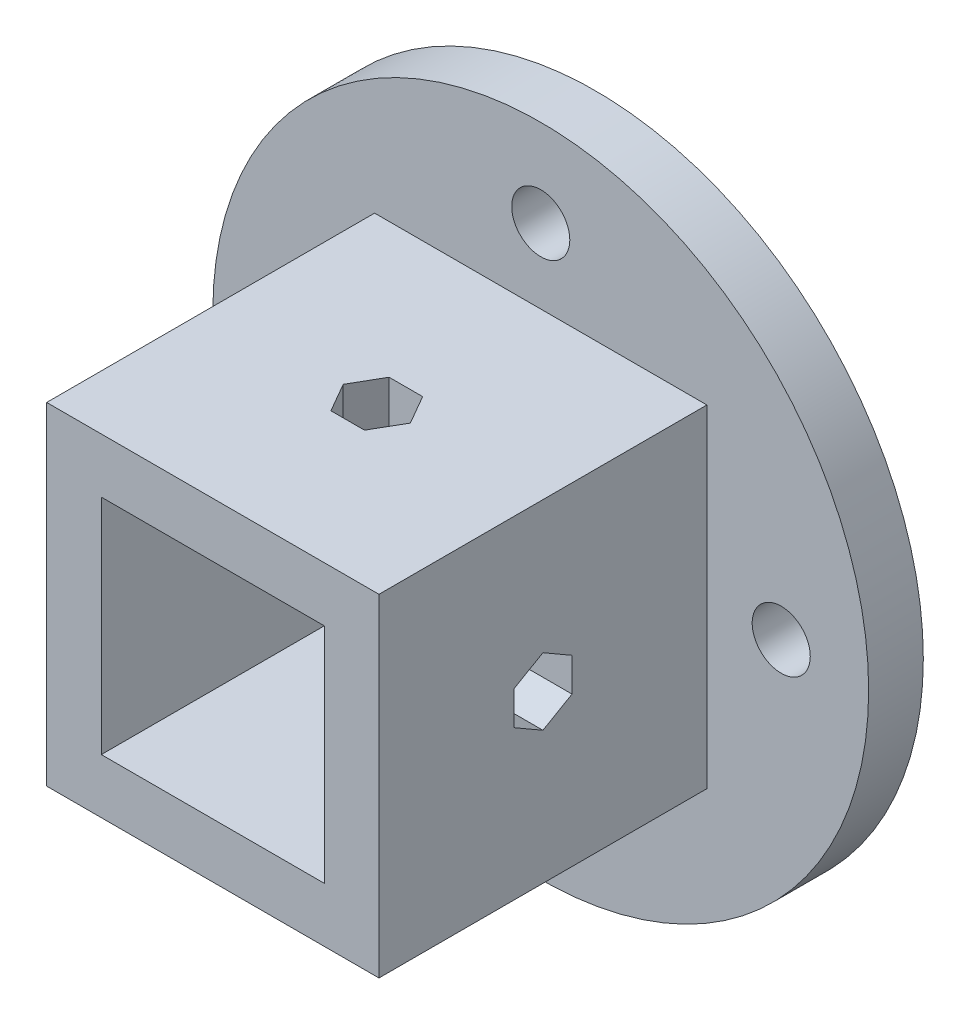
ISO-10303-21;
HEADER;
FILE_DESCRIPTION(('STEP AP214'),'2;1');
FILE_NAME('part.step','',(''),(''),'','','');
FILE_SCHEMA(('AUTOMOTIVE_DESIGN { 1 0 10303 214 1 1 1 1 }'));
ENDSEC;
DATA;
#1=APPLICATION_CONTEXT('core data for automotive mechanical design processes');
#2=APPLICATION_PROTOCOL_DEFINITION('international standard','automotive_design',2000,#1);
#3=PRODUCT_CONTEXT('',#1,'mechanical');
#4=PRODUCT('Part','Part','',(#3));
#5=PRODUCT_RELATED_PRODUCT_CATEGORY('part','',(#4));
#6=PRODUCT_DEFINITION_FORMATION('','',#4);
#7=PRODUCT_DEFINITION_CONTEXT('part definition',#1,'design');
#8=PRODUCT_DEFINITION('design','',#6,#7);
#9=PRODUCT_DEFINITION_SHAPE('','',#8);
#10=(LENGTH_UNIT() NAMED_UNIT(*) SI_UNIT(.MILLI.,.METRE.));
#11=(NAMED_UNIT(*) PLANE_ANGLE_UNIT() SI_UNIT($,.RADIAN.));
#12=(NAMED_UNIT(*) SI_UNIT($,.STERADIAN.) SOLID_ANGLE_UNIT());
#13=UNCERTAINTY_MEASURE_WITH_UNIT(LENGTH_MEASURE(1.E-05),#10,'distance_accuracy_value','');
#14=(GEOMETRIC_REPRESENTATION_CONTEXT(3) GLOBAL_UNCERTAINTY_ASSIGNED_CONTEXT((#13)) GLOBAL_UNIT_ASSIGNED_CONTEXT((#10,
#11,#12)) REPRESENTATION_CONTEXT('',''));
#15=CARTESIAN_POINT('',(0.,0.,0.));
#16=DIRECTION('',(0.,0.,1.));
#17=DIRECTION('',(1.,0.,0.));
#18=AXIS2_PLACEMENT_3D('',#15,#16,#17);
#19=CARTESIAN_POINT('',(-27.94,0.,6.35));
#20=DIRECTION('',(0.,0.,-1.));
#21=DIRECTION('',(-1.,0.,0.));
#22=AXIS2_PLACEMENT_3D('',#19,#20,#21);
#23=CYLINDRICAL_SURFACE('',#22,3.375);
#24=CARTESIAN_POINT('',(-27.94,0.,6.35));
#25=DIRECTION('',(0.,0.,1.));
#26=DIRECTION('',(1.,0.,0.));
#27=AXIS2_PLACEMENT_3D('',#24,#25,#26);
#28=CIRCLE('',#27,3.375);
#29=CARTESIAN_POINT('',(-24.565,0.,6.35));
#30=VERTEX_POINT('',#29);
#31=EDGE_CURVE('E538',#30,#30,#28,.T.);
#32=ORIENTED_EDGE('',*,*,#31,.T.);
#33=EDGE_LOOP('',(#32));
#34=FACE_BOUND('',#33,.T.);
#35=CARTESIAN_POINT('',(-27.94,0.,0.));
#36=DIRECTION('',(0.,0.,1.));
#37=DIRECTION('',(1.,0.,0.));
#38=AXIS2_PLACEMENT_3D('',#35,#36,#37);
#39=CIRCLE('',#38,3.375);
#40=CARTESIAN_POINT('',(-24.565,0.,0.));
#41=VERTEX_POINT('',#40);
#42=EDGE_CURVE('E572',#41,#41,#39,.T.);
#43=ORIENTED_EDGE('',*,*,#42,.F.);
#44=EDGE_LOOP('',(#43));
#45=FACE_BOUND('',#44,.T.);
#46=ADVANCED_FACE('F47',(#34,#45),#23,.F.);
#47=CARTESIAN_POINT('',(0.,27.94,6.35));
#48=DIRECTION('',(0.,0.,-1.));
#49=DIRECTION('',(-1.,0.,0.));
#50=AXIS2_PLACEMENT_3D('',#47,#48,#49);
#51=CYLINDRICAL_SURFACE('',#50,3.375);
#52=CARTESIAN_POINT('',(0.,27.94,6.35));
#53=DIRECTION('',(0.,0.,1.));
#54=DIRECTION('',(1.,0.,0.));
#55=AXIS2_PLACEMENT_3D('',#52,#53,#54);
#56=CIRCLE('',#55,3.375);
#57=CARTESIAN_POINT('',(3.37500000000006,27.94,6.35));
#58=VERTEX_POINT('',#57);
#59=EDGE_CURVE('E534',#58,#58,#56,.T.);
#60=ORIENTED_EDGE('',*,*,#59,.T.);
#61=EDGE_LOOP('',(#60));
#62=FACE_BOUND('',#61,.T.);
#63=CARTESIAN_POINT('',(0.,27.94,0.));
#64=DIRECTION('',(0.,0.,1.));
#65=DIRECTION('',(1.,0.,0.));
#66=AXIS2_PLACEMENT_3D('',#63,#64,#65);
#67=CIRCLE('',#66,3.375);
#68=CARTESIAN_POINT('',(3.37500000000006,27.94,0.));
#69=VERTEX_POINT('',#68);
#70=EDGE_CURVE('E568',#69,#69,#67,.T.);
#71=ORIENTED_EDGE('',*,*,#70,.F.);
#72=EDGE_LOOP('',(#71));
#73=FACE_BOUND('',#72,.T.);
#74=ADVANCED_FACE('F708',(#62,#73),#51,.F.);
#75=CARTESIAN_POINT('',(27.9400000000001,0.,6.35));
#76=DIRECTION('',(0.,0.,-1.));
#77=DIRECTION('',(-1.,0.,0.));
#78=AXIS2_PLACEMENT_3D('',#75,#76,#77);
#79=CYLINDRICAL_SURFACE('',#78,3.375);
#80=CARTESIAN_POINT('',(27.9400000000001,0.,6.35));
#81=DIRECTION('',(0.,0.,1.));
#82=DIRECTION('',(1.,0.,0.));
#83=AXIS2_PLACEMENT_3D('',#80,#81,#82);
#84=CIRCLE('',#83,3.375);
#85=CARTESIAN_POINT('',(31.3150000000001,0.,6.35));
#86=VERTEX_POINT('',#85);
#87=EDGE_CURVE('E529',#86,#86,#84,.T.);
#88=ORIENTED_EDGE('',*,*,#87,.T.);
#89=EDGE_LOOP('',(#88));
#90=FACE_BOUND('',#89,.T.);
#91=CARTESIAN_POINT('',(27.9400000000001,0.,0.));
#92=DIRECTION('',(0.,0.,1.));
#93=DIRECTION('',(1.,0.,0.));
#94=AXIS2_PLACEMENT_3D('',#91,#92,#93);
#95=CIRCLE('',#94,3.375);
#96=CARTESIAN_POINT('',(31.3150000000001,0.,0.));
#97=VERTEX_POINT('',#96);
#98=EDGE_CURVE('E564',#97,#97,#95,.T.);
#99=ORIENTED_EDGE('',*,*,#98,.F.);
#100=EDGE_LOOP('',(#99));
#101=FACE_BOUND('',#100,.T.);
#102=ADVANCED_FACE('F714',(#90,#101),#79,.F.);
#103=CARTESIAN_POINT('',(0.,-27.9400000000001,6.35));
#104=DIRECTION('',(0.,0.,-1.));
#105=DIRECTION('',(-1.,0.,0.));
#106=AXIS2_PLACEMENT_3D('',#103,#104,#105);
#107=CYLINDRICAL_SURFACE('',#106,3.375);
#108=CARTESIAN_POINT('',(0.,-27.9400000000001,6.35));
#109=DIRECTION('',(0.,0.,1.));
#110=DIRECTION('',(1.,0.,0.));
#111=AXIS2_PLACEMENT_3D('',#108,#109,#110);
#112=CIRCLE('',#111,3.375);
#113=CARTESIAN_POINT('',(3.37499999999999,-27.9400000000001,6.35));
#114=VERTEX_POINT('',#113);
#115=EDGE_CURVE('E525',#114,#114,#112,.T.);
#116=ORIENTED_EDGE('',*,*,#115,.T.);
#117=EDGE_LOOP('',(#116));
#118=FACE_BOUND('',#117,.T.);
#119=CARTESIAN_POINT('',(0.,-27.9400000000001,0.));
#120=DIRECTION('',(0.,0.,1.));
#121=DIRECTION('',(1.,0.,0.));
#122=AXIS2_PLACEMENT_3D('',#119,#120,#121);
#123=CIRCLE('',#122,3.375);
#124=CARTESIAN_POINT('',(3.37499999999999,-27.9400000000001,0.));
#125=VERTEX_POINT('',#124);
#126=EDGE_CURVE('E510',#125,#125,#123,.T.);
#127=ORIENTED_EDGE('',*,*,#126,.F.);
#128=EDGE_LOOP('',(#127));
#129=FACE_BOUND('',#128,.T.);
#130=ADVANCED_FACE('F49',(#118,#129),#107,.F.);
#131=CARTESIAN_POINT('',(0.,0.,6.35));
#132=DIRECTION('',(0.,0.,-1.));
#133=DIRECTION('',(-1.,0.,0.));
#134=AXIS2_PLACEMENT_3D('',#131,#132,#133);
#135=CYLINDRICAL_SURFACE('',#134,38.1);
#136=CARTESIAN_POINT('',(0.,0.,6.35));
#137=DIRECTION('',(0.,0.,1.));
#138=DIRECTION('',(1.,0.,0.));
#139=AXIS2_PLACEMENT_3D('',#136,#137,#138);
#140=CIRCLE('',#139,38.1);
#141=CARTESIAN_POINT('',(38.1,0.,6.35));
#142=VERTEX_POINT('',#141);
#143=EDGE_CURVE('E556',#142,#142,#140,.T.);
#144=ORIENTED_EDGE('',*,*,#143,.F.);
#145=EDGE_LOOP('',(#144));
#146=FACE_BOUND('',#145,.T.);
#147=CARTESIAN_POINT('',(0.,0.,0.));
#148=DIRECTION('',(0.,0.,1.));
#149=DIRECTION('',(1.,0.,0.));
#150=AXIS2_PLACEMENT_3D('',#147,#148,#149);
#151=CIRCLE('',#150,38.1);
#152=CARTESIAN_POINT('',(38.1,0.,0.));
#153=VERTEX_POINT('',#152);
#154=EDGE_CURVE('E530',#153,#153,#151,.T.);
#155=ORIENTED_EDGE('',*,*,#154,.T.);
#156=EDGE_LOOP('',(#155));
#157=FACE_BOUND('',#156,.T.);
#158=ADVANCED_FACE('F719',(#146,#157),#135,.T.);
#159=CARTESIAN_POINT('',(0.,0.,6.35));
#160=DIRECTION('',(0.,0.,1.));
#161=DIRECTION('',(1.,0.,0.));
#162=AXIS2_PLACEMENT_3D('',#159,#160,#161);
#163=PLANE('',#162);
#164=ORIENTED_EDGE('',*,*,#115,.F.);
#165=EDGE_LOOP('',(#164));
#166=FACE_BOUND('',#165,.T.);
#167=ORIENTED_EDGE('',*,*,#87,.F.);
#168=EDGE_LOOP('',(#167));
#169=FACE_BOUND('',#168,.T.);
#170=ORIENTED_EDGE('',*,*,#59,.F.);
#171=EDGE_LOOP('',(#170));
#172=FACE_BOUND('',#171,.T.);
#173=ORIENTED_EDGE('',*,*,#31,.F.);
#174=EDGE_LOOP('',(#173));
#175=FACE_BOUND('',#174,.T.);
#176=DIRECTION('',(0.,-1.,0.));
#177=VECTOR('',#176,1.);
#178=CARTESIAN_POINT('',(19.304,0.,6.35));
#179=LINE('',#178,#177);
#180=CARTESIAN_POINT('',(19.304,19.304,6.35));
#181=VERTEX_POINT('',#180);
#182=CARTESIAN_POINT('',(19.304,-19.304,6.35));
#183=VERTEX_POINT('',#182);
#184=EDGE_CURVE('E542',#181,#183,#179,.T.);
#185=ORIENTED_EDGE('',*,*,#184,.T.);
#186=DIRECTION('',(-1.,0.,0.));
#187=VECTOR('',#186,1.);
#188=CARTESIAN_POINT('',(0.,-19.304,6.35));
#189=LINE('',#188,#187);
#190=CARTESIAN_POINT('',(-19.304,-19.304,6.35));
#191=VERTEX_POINT('',#190);
#192=EDGE_CURVE('E545',#183,#191,#189,.T.);
#193=ORIENTED_EDGE('',*,*,#192,.T.);
#194=DIRECTION('',(0.,-1.,0.));
#195=VECTOR('',#194,1.);
#196=CARTESIAN_POINT('',(-19.304,0.,6.35));
#197=LINE('',#196,#195);
#198=CARTESIAN_POINT('',(-19.304,19.304,6.35));
#199=VERTEX_POINT('',#198);
#200=EDGE_CURVE('E548',#199,#191,#197,.T.);
#201=ORIENTED_EDGE('',*,*,#200,.F.);
#202=DIRECTION('',(-1.,0.,0.));
#203=VECTOR('',#202,1.);
#204=CARTESIAN_POINT('',(0.,19.304,6.35));
#205=LINE('',#204,#203);
#206=EDGE_CURVE('E552',#181,#199,#205,.T.);
#207=ORIENTED_EDGE('',*,*,#206,.F.);
#208=EDGE_LOOP('',(#185,#193,#201,#207));
#209=FACE_BOUND('',#208,.T.);
#210=ORIENTED_EDGE('',*,*,#143,.T.);
#211=EDGE_LOOP('',(#210));
#212=FACE_BOUND('',#211,.T.);
#213=ADVANCED_FACE('F735',(#166,#169,#172,#175,#209,#212),#163,.T.);
#214=CARTESIAN_POINT('',(0.,0.,0.));
#215=DIRECTION('',(0.,0.,1.));
#216=DIRECTION('',(1.,0.,0.));
#217=AXIS2_PLACEMENT_3D('',#214,#215,#216);
#218=PLANE('',#217);
#219=ORIENTED_EDGE('',*,*,#126,.T.);
#220=EDGE_LOOP('',(#219));
#221=FACE_BOUND('',#220,.T.);
#222=ORIENTED_EDGE('',*,*,#98,.T.);
#223=EDGE_LOOP('',(#222));
#224=FACE_BOUND('',#223,.T.);
#225=ORIENTED_EDGE('',*,*,#70,.T.);
#226=EDGE_LOOP('',(#225));
#227=FACE_BOUND('',#226,.T.);
#228=ORIENTED_EDGE('',*,*,#42,.T.);
#229=EDGE_LOOP('',(#228));
#230=FACE_BOUND('',#229,.T.);
#231=ORIENTED_EDGE('',*,*,#154,.F.);
#232=EDGE_LOOP('',(#231));
#233=FACE_BOUND('',#232,.T.);
#234=DIRECTION('',(0.,-1.,0.));
#235=VECTOR('',#234,1.);
#236=CARTESIAN_POINT('',(12.954,0.,0.));
#237=LINE('',#236,#235);
#238=CARTESIAN_POINT('',(12.954,12.954,0.));
#239=VERTEX_POINT('',#238);
#240=CARTESIAN_POINT('',(12.954,-12.954,0.));
#241=VERTEX_POINT('',#240);
#242=EDGE_CURVE('E450',#239,#241,#237,.T.);
#243=ORIENTED_EDGE('',*,*,#242,.F.);
#244=DIRECTION('',(-1.,0.,0.));
#245=VECTOR('',#244,1.);
#246=CARTESIAN_POINT('',(0.,12.954,0.));
#247=LINE('',#246,#245);
#248=CARTESIAN_POINT('',(-12.954,12.954,0.));
#249=VERTEX_POINT('',#248);
#250=EDGE_CURVE('E456',#239,#249,#247,.T.);
#251=ORIENTED_EDGE('',*,*,#250,.T.);
#252=DIRECTION('',(0.,-1.,0.));
#253=VECTOR('',#252,1.);
#254=CARTESIAN_POINT('',(-12.954,0.,0.));
#255=LINE('',#254,#253);
#256=CARTESIAN_POINT('',(-12.954,-12.954,0.));
#257=VERTEX_POINT('',#256);
#258=EDGE_CURVE('E489',#249,#257,#255,.T.);
#259=ORIENTED_EDGE('',*,*,#258,.T.);
#260=DIRECTION('',(-1.,0.,0.));
#261=VECTOR('',#260,1.);
#262=CARTESIAN_POINT('',(0.,-12.954,0.));
#263=LINE('',#262,#261);
#264=EDGE_CURVE('E485',#241,#257,#263,.T.);
#265=ORIENTED_EDGE('',*,*,#264,.F.);
#266=EDGE_LOOP('',(#243,#251,#259,#265));
#267=FACE_BOUND('',#266,.T.);
#268=ADVANCED_FACE('F731',(#221,#224,#227,#230,#233,#267),#218,.F.);
#269=CARTESIAN_POINT('',(12.954,0.,44.45));
#270=DIRECTION('',(1.,0.,0.));
#271=DIRECTION('',(0.,0.,-1.));
#272=AXIS2_PLACEMENT_3D('',#269,#270,#271);
#273=PLANE('',#272);
#274=DIRECTION('',(0.,-0.5,0.866025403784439));
#275=VECTOR('',#274,1.);
#276=CARTESIAN_POINT('',(12.954,-5.32328495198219,41.3766));
#277=LINE('',#276,#275);
#278=CARTESIAN_POINT('',(12.954,3.90080935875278,25.4));
#279=VERTEX_POINT('',#278);
#280=CARTESIAN_POINT('',(12.954,1.95040467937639,28.7782));
#281=VERTEX_POINT('',#280);
#282=EDGE_CURVE('E343',#279,#281,#277,.T.);
#283=ORIENTED_EDGE('',*,*,#282,.T.);
#284=DIRECTION('',(0.,-1.,0.));
#285=VECTOR('',#284,1.);
#286=CARTESIAN_POINT('',(12.954,0.,28.7782));
#287=LINE('',#286,#285);
#288=CARTESIAN_POINT('',(12.954,-1.9504046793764,28.7782));
#289=VERTEX_POINT('',#288);
#290=EDGE_CURVE('E350',#281,#289,#287,.T.);
#291=ORIENTED_EDGE('',*,*,#290,.T.);
#292=DIRECTION('',(0.,-0.5,-0.866025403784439));
#293=VECTOR('',#292,1.);
#294=CARTESIAN_POINT('',(12.954,5.32328495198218,41.3766));
#295=LINE('',#294,#293);
#296=CARTESIAN_POINT('',(12.954,-3.90080935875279,25.4));
#297=VERTEX_POINT('',#296);
#298=EDGE_CURVE('E318',#289,#297,#295,.T.);
#299=ORIENTED_EDGE('',*,*,#298,.T.);
#300=DIRECTION('',(0.,0.5,-0.866025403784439));
#301=VECTOR('',#300,1.);
#302=CARTESIAN_POINT('',(12.954,-11.1744989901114,37.9984));
#303=LINE('',#302,#301);
#304=CARTESIAN_POINT('',(12.954,-1.9504046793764,22.0218));
#305=VERTEX_POINT('',#304);
#306=EDGE_CURVE('E262',#297,#305,#303,.T.);
#307=ORIENTED_EDGE('',*,*,#306,.T.);
#308=DIRECTION('',(0.,1.,0.));
#309=VECTOR('',#308,1.);
#310=CARTESIAN_POINT('',(12.954,0.,22.0218));
#311=LINE('',#310,#309);
#312=CARTESIAN_POINT('',(12.954,1.95040467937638,22.0218));
#313=VERTEX_POINT('',#312);
#314=EDGE_CURVE('E329',#305,#313,#311,.T.);
#315=ORIENTED_EDGE('',*,*,#314,.T.);
#316=DIRECTION('',(0.,0.5,0.866025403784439));
#317=VECTOR('',#316,1.);
#318=CARTESIAN_POINT('',(12.954,11.1744989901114,37.9984));
#319=LINE('',#318,#317);
#320=EDGE_CURVE('E336',#313,#279,#319,.T.);
#321=ORIENTED_EDGE('',*,*,#320,.T.);
#322=EDGE_LOOP('',(#283,#291,#299,#307,#315,#321));
#323=FACE_BOUND('',#322,.T.);
#324=ORIENTED_EDGE('',*,*,#242,.T.);
#325=DIRECTION('',(0.,0.,-1.));
#326=VECTOR('',#325,1.);
#327=CARTESIAN_POINT('',(12.954,-12.954,44.45));
#328=LINE('',#327,#326);
#329=CARTESIAN_POINT('',(12.954,-12.954,44.45));
#330=VERTEX_POINT('',#329);
#331=EDGE_CURVE('E506',#330,#241,#328,.T.);
#332=ORIENTED_EDGE('',*,*,#331,.F.);
#333=DIRECTION('',(0.,-1.,0.));
#334=VECTOR('',#333,1.);
#335=CARTESIAN_POINT('',(12.954,0.,44.45));
#336=LINE('',#335,#334);
#337=CARTESIAN_POINT('',(12.954,12.954,44.45));
#338=VERTEX_POINT('',#337);
#339=EDGE_CURVE('E466',#338,#330,#336,.T.);
#340=ORIENTED_EDGE('',*,*,#339,.F.);
#341=DIRECTION('',(0.,0.,-1.));
#342=VECTOR('',#341,1.);
#343=CARTESIAN_POINT('',(12.954,12.954,44.45));
#344=LINE('',#343,#342);
#345=EDGE_CURVE('E496',#338,#239,#344,.T.);
#346=ORIENTED_EDGE('',*,*,#345,.T.);
#347=EDGE_LOOP('',(#324,#332,#340,#346));
#348=FACE_BOUND('',#347,.T.);
#349=ADVANCED_FACE('F734',(#323,#348),#273,.F.);
#350=CARTESIAN_POINT('',(0.,-12.954,44.45));
#351=DIRECTION('',(0.,-1.,0.));
#352=DIRECTION('',(0.,0.,-1.));
#353=AXIS2_PLACEMENT_3D('',#350,#351,#352);
#354=PLANE('',#353);
#355=DIRECTION('',(-0.5,0.,0.866025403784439));
#356=VECTOR('',#355,1.);
#357=CARTESIAN_POINT('',(-5.32328495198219,-12.954,41.3766));
#358=LINE('',#357,#356);
#359=CARTESIAN_POINT('',(3.90080935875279,-12.954,25.4));
#360=VERTEX_POINT('',#359);
#361=CARTESIAN_POINT('',(1.95040467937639,-12.954,28.7782));
#362=VERTEX_POINT('',#361);
#363=EDGE_CURVE('E434',#360,#362,#358,.T.);
#364=ORIENTED_EDGE('',*,*,#363,.T.);
#365=DIRECTION('',(-1.,0.,0.));
#366=VECTOR('',#365,1.);
#367=CARTESIAN_POINT('',(0.,-12.954,28.7782));
#368=LINE('',#367,#366);
#369=CARTESIAN_POINT('',(-1.95040467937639,-12.954,28.7782));
#370=VERTEX_POINT('',#369);
#371=EDGE_CURVE('E446',#362,#370,#368,.T.);
#372=ORIENTED_EDGE('',*,*,#371,.T.);
#373=DIRECTION('',(-0.5,0.,-0.866025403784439));
#374=VECTOR('',#373,1.);
#375=CARTESIAN_POINT('',(5.32328495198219,-12.954,41.3766));
#376=LINE('',#375,#374);
#377=CARTESIAN_POINT('',(-3.90080935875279,-12.954,25.4));
#378=VERTEX_POINT('',#377);
#379=EDGE_CURVE('E390',#370,#378,#376,.T.);
#380=ORIENTED_EDGE('',*,*,#379,.T.);
#381=DIRECTION('',(0.5,0.,-0.866025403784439));
#382=VECTOR('',#381,1.);
#383=CARTESIAN_POINT('',(-11.1744989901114,-12.954,37.9984));
#384=LINE('',#383,#382);
#385=CARTESIAN_POINT('',(-1.95040467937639,-12.954,22.0218));
#386=VERTEX_POINT('',#385);
#387=EDGE_CURVE('E401',#378,#386,#384,.T.);
#388=ORIENTED_EDGE('',*,*,#387,.T.);
#389=DIRECTION('',(1.,0.,0.));
#390=VECTOR('',#389,1.);
#391=CARTESIAN_POINT('',(0.,-12.954,22.0218));
#392=LINE('',#391,#390);
#393=CARTESIAN_POINT('',(1.95040467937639,-12.954,22.0218));
#394=VERTEX_POINT('',#393);
#395=EDGE_CURVE('E412',#386,#394,#392,.T.);
#396=ORIENTED_EDGE('',*,*,#395,.T.);
#397=DIRECTION('',(0.5,0.,0.866025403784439));
#398=VECTOR('',#397,1.);
#399=CARTESIAN_POINT('',(11.1744989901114,-12.954,37.9984));
#400=LINE('',#399,#398);
#401=EDGE_CURVE('E423',#394,#360,#400,.T.);
#402=ORIENTED_EDGE('',*,*,#401,.T.);
#403=EDGE_LOOP('',(#364,#372,#380,#388,#396,#402));
#404=FACE_BOUND('',#403,.T.);
#405=ORIENTED_EDGE('',*,*,#264,.T.);
#406=DIRECTION('',(0.,0.,-1.));
#407=VECTOR('',#406,1.);
#408=CARTESIAN_POINT('',(-12.954,-12.954,44.45));
#409=LINE('',#408,#407);
#410=CARTESIAN_POINT('',(-12.954,-12.954,44.45));
#411=VERTEX_POINT('',#410);
#412=EDGE_CURVE('E503',#411,#257,#409,.T.);
#413=ORIENTED_EDGE('',*,*,#412,.F.);
#414=DIRECTION('',(-1.,0.,0.));
#415=VECTOR('',#414,1.);
#416=CARTESIAN_POINT('',(0.,-12.954,44.45));
#417=LINE('',#416,#415);
#418=EDGE_CURVE('E470',#330,#411,#417,.T.);
#419=ORIENTED_EDGE('',*,*,#418,.F.);
#420=ORIENTED_EDGE('',*,*,#331,.T.);
#421=EDGE_LOOP('',(#405,#413,#419,#420));
#422=FACE_BOUND('',#421,.T.);
#423=ADVANCED_FACE('F753',(#404,#422),#354,.F.);
#424=CARTESIAN_POINT('',(-12.954,0.,44.45));
#425=DIRECTION('',(1.,0.,0.));
#426=DIRECTION('',(0.,0.,-1.));
#427=AXIS2_PLACEMENT_3D('',#424,#425,#426);
#428=PLANE('',#427);
#429=DIRECTION('',(0.,-1.,0.));
#430=VECTOR('',#429,1.);
#431=CARTESIAN_POINT('',(-12.954,0.,28.7782));
#432=LINE('',#431,#430);
#433=CARTESIAN_POINT('',(-12.954,1.95040467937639,28.7782));
#434=VERTEX_POINT('',#433);
#435=CARTESIAN_POINT('',(-12.954,-1.9504046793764,28.7782));
#436=VERTEX_POINT('',#435);
#437=EDGE_CURVE('E347',#434,#436,#432,.T.);
#438=ORIENTED_EDGE('',*,*,#437,.F.);
#439=DIRECTION('',(0.,-0.5,0.866025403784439));
#440=VECTOR('',#439,1.);
#441=CARTESIAN_POINT('',(-12.954,-5.32328495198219,41.3766));
#442=LINE('',#441,#440);
#443=CARTESIAN_POINT('',(-12.954,3.90080935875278,25.4));
#444=VERTEX_POINT('',#443);
#445=EDGE_CURVE('E340',#444,#434,#442,.T.);
#446=ORIENTED_EDGE('',*,*,#445,.F.);
#447=DIRECTION('',(0.,0.5,0.866025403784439));
#448=VECTOR('',#447,1.);
#449=CARTESIAN_POINT('',(-12.954,11.1744989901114,37.9984));
#450=LINE('',#449,#448);
#451=CARTESIAN_POINT('',(-12.954,1.95040467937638,22.0218));
#452=VERTEX_POINT('',#451);
#453=EDGE_CURVE('E333',#452,#444,#450,.T.);
#454=ORIENTED_EDGE('',*,*,#453,.F.);
#455=DIRECTION('',(0.,1.,0.));
#456=VECTOR('',#455,1.);
#457=CARTESIAN_POINT('',(-12.954,0.,22.0218));
#458=LINE('',#457,#456);
#459=CARTESIAN_POINT('',(-12.954,-1.9504046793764,22.0218));
#460=VERTEX_POINT('',#459);
#461=EDGE_CURVE('E326',#460,#452,#458,.T.);
#462=ORIENTED_EDGE('',*,*,#461,.F.);
#463=DIRECTION('',(0.,0.5,-0.866025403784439));
#464=VECTOR('',#463,1.);
#465=CARTESIAN_POINT('',(-12.954,-11.1744989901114,37.9984));
#466=LINE('',#465,#464);
#467=CARTESIAN_POINT('',(-12.954,-3.90080935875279,25.4));
#468=VERTEX_POINT('',#467);
#469=EDGE_CURVE('E321',#468,#460,#466,.T.);
#470=ORIENTED_EDGE('',*,*,#469,.F.);
#471=DIRECTION('',(0.,-0.5,-0.866025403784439));
#472=VECTOR('',#471,1.);
#473=CARTESIAN_POINT('',(-12.954,5.32328495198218,41.3766));
#474=LINE('',#473,#472);
#475=EDGE_CURVE('E315',#436,#468,#474,.T.);
#476=ORIENTED_EDGE('',*,*,#475,.F.);
#477=EDGE_LOOP('',(#438,#446,#454,#462,#470,#476));
#478=FACE_BOUND('',#477,.T.);
#479=ORIENTED_EDGE('',*,*,#258,.F.);
#480=DIRECTION('',(0.,0.,-1.));
#481=VECTOR('',#480,1.);
#482=CARTESIAN_POINT('',(-12.954,12.954,44.45));
#483=LINE('',#482,#481);
#484=CARTESIAN_POINT('',(-12.954,12.954,44.45));
#485=VERTEX_POINT('',#484);
#486=EDGE_CURVE('E499',#485,#249,#483,.T.);
#487=ORIENTED_EDGE('',*,*,#486,.F.);
#488=DIRECTION('',(0.,-1.,0.));
#489=VECTOR('',#488,1.);
#490=CARTESIAN_POINT('',(-12.954,0.,44.45));
#491=LINE('',#490,#489);
#492=EDGE_CURVE('E473',#485,#411,#491,.T.);
#493=ORIENTED_EDGE('',*,*,#492,.T.);
#494=ORIENTED_EDGE('',*,*,#412,.T.);
#495=EDGE_LOOP('',(#479,#487,#493,#494));
#496=FACE_BOUND('',#495,.T.);
#497=ADVANCED_FACE('F646',(#478,#496),#428,.T.);
#498=CARTESIAN_POINT('',(0.,-19.304,44.45));
#499=DIRECTION('',(0.,-1.,0.));
#500=DIRECTION('',(0.,0.,-1.));
#501=AXIS2_PLACEMENT_3D('',#498,#499,#500);
#502=PLANE('',#501);
#503=DIRECTION('',(-1.,0.,0.));
#504=VECTOR('',#503,1.);
#505=CARTESIAN_POINT('',(0.,-19.304,28.7782));
#506=LINE('',#505,#504);
#507=CARTESIAN_POINT('',(1.95040467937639,-19.304,28.7782));
#508=VERTEX_POINT('',#507);
#509=CARTESIAN_POINT('',(-1.95040467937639,-19.304,28.7782));
#510=VERTEX_POINT('',#509);
#511=EDGE_CURVE('E442',#508,#510,#506,.T.);
#512=ORIENTED_EDGE('',*,*,#511,.F.);
#513=DIRECTION('',(-0.5,0.,0.866025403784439));
#514=VECTOR('',#513,1.);
#515=CARTESIAN_POINT('',(-5.32328495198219,-19.304,41.3766));
#516=LINE('',#515,#514);
#517=CARTESIAN_POINT('',(3.90080935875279,-19.304,25.4));
#518=VERTEX_POINT('',#517);
#519=EDGE_CURVE('E431',#518,#508,#516,.T.);
#520=ORIENTED_EDGE('',*,*,#519,.F.);
#521=DIRECTION('',(0.5,0.,0.866025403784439));
#522=VECTOR('',#521,1.);
#523=CARTESIAN_POINT('',(11.1744989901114,-19.304,37.9984));
#524=LINE('',#523,#522);
#525=CARTESIAN_POINT('',(1.95040467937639,-19.304,22.0218));
#526=VERTEX_POINT('',#525);
#527=EDGE_CURVE('E420',#526,#518,#524,.T.);
#528=ORIENTED_EDGE('',*,*,#527,.F.);
#529=DIRECTION('',(1.,0.,0.));
#530=VECTOR('',#529,1.);
#531=CARTESIAN_POINT('',(0.,-19.304,22.0218));
#532=LINE('',#531,#530);
#533=CARTESIAN_POINT('',(-1.95040467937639,-19.304,22.0218));
#534=VERTEX_POINT('',#533);
#535=EDGE_CURVE('E409',#534,#526,#532,.T.);
#536=ORIENTED_EDGE('',*,*,#535,.F.);
#537=DIRECTION('',(0.5,0.,-0.866025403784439));
#538=VECTOR('',#537,1.);
#539=CARTESIAN_POINT('',(-11.1744989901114,-19.304,37.9984));
#540=LINE('',#539,#538);
#541=CARTESIAN_POINT('',(-3.90080935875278,-19.304,25.4));
#542=VERTEX_POINT('',#541);
#543=EDGE_CURVE('E398',#542,#534,#540,.T.);
#544=ORIENTED_EDGE('',*,*,#543,.F.);
#545=DIRECTION('',(-0.5,0.,-0.866025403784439));
#546=VECTOR('',#545,1.);
#547=CARTESIAN_POINT('',(5.32328495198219,-19.304,41.3766));
#548=LINE('',#547,#546);
#549=EDGE_CURVE('E387',#510,#542,#548,.T.);
#550=ORIENTED_EDGE('',*,*,#549,.F.);
#551=EDGE_LOOP('',(#512,#520,#528,#536,#544,#550));
#552=FACE_BOUND('',#551,.T.);
#553=DIRECTION('',(0.,0.,-1.));
#554=VECTOR('',#553,1.);
#555=CARTESIAN_POINT('',(-19.304,-19.304,44.45));
#556=LINE('',#555,#554);
#557=CARTESIAN_POINT('',(-19.304,-19.304,44.45));
#558=VERTEX_POINT('',#557);
#559=EDGE_CURVE('E481',#558,#191,#556,.T.);
#560=ORIENTED_EDGE('',*,*,#559,.T.);
#561=ORIENTED_EDGE('',*,*,#192,.F.);
#562=DIRECTION('',(0.,0.,-1.));
#563=VECTOR('',#562,1.);
#564=CARTESIAN_POINT('',(19.304,-19.304,44.45));
#565=LINE('',#564,#563);
#566=CARTESIAN_POINT('',(19.304,-19.304,44.45));
#567=VERTEX_POINT('',#566);
#568=EDGE_CURVE('E500',#567,#183,#565,.T.);
#569=ORIENTED_EDGE('',*,*,#568,.F.);
#570=DIRECTION('',(-1.,0.,0.));
#571=VECTOR('',#570,1.);
#572=CARTESIAN_POINT('',(0.,-19.304,44.45));
#573=LINE('',#572,#571);
#574=EDGE_CURVE('E451',#567,#558,#573,.T.);
#575=ORIENTED_EDGE('',*,*,#574,.T.);
#576=EDGE_LOOP('',(#560,#561,#569,#575));
#577=FACE_BOUND('',#576,.T.);
#578=ADVANCED_FACE('F773',(#552,#577),#502,.T.);
#579=CARTESIAN_POINT('',(19.304,0.,44.45));
#580=DIRECTION('',(1.,0.,0.));
#581=DIRECTION('',(0.,0.,-1.));
#582=AXIS2_PLACEMENT_3D('',#579,#580,#581);
#583=PLANE('',#582);
#584=DIRECTION('',(0.,-1.,0.));
#585=VECTOR('',#584,1.);
#586=CARTESIAN_POINT('',(19.304,0.,28.7782));
#587=LINE('',#586,#585);
#588=CARTESIAN_POINT('',(19.304,1.95040467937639,28.7782));
#589=VERTEX_POINT('',#588);
#590=CARTESIAN_POINT('',(19.304,-1.9504046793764,28.7782));
#591=VERTEX_POINT('',#590);
#592=EDGE_CURVE('E276',#589,#591,#587,.T.);
#593=ORIENTED_EDGE('',*,*,#592,.F.);
#594=DIRECTION('',(0.,-0.5,0.866025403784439));
#595=VECTOR('',#594,1.);
#596=CARTESIAN_POINT('',(19.304,13.924129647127,8.03909999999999));
#597=LINE('',#596,#595);
#598=CARTESIAN_POINT('',(19.304,3.90080935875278,25.4));
#599=VERTEX_POINT('',#598);
#600=EDGE_CURVE('E293',#599,#589,#597,.T.);
#601=ORIENTED_EDGE('',*,*,#600,.F.);
#602=DIRECTION('',(0.,0.5,0.866025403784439));
#603=VECTOR('',#602,1.);
#604=CARTESIAN_POINT('',(19.304,-8.07291560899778,4.6609));
#605=LINE('',#604,#603);
#606=CARTESIAN_POINT('',(19.304,1.95040467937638,22.0218));
#607=VERTEX_POINT('',#606);
#608=EDGE_CURVE('E286',#607,#599,#605,.T.);
#609=ORIENTED_EDGE('',*,*,#608,.F.);
#610=DIRECTION('',(0.,1.,0.));
#611=VECTOR('',#610,1.);
#612=CARTESIAN_POINT('',(19.304,0.,22.0218));
#613=LINE('',#612,#611);
#614=CARTESIAN_POINT('',(19.304,-1.9504046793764,22.0218));
#615=VERTEX_POINT('',#614);
#616=EDGE_CURVE('E282',#615,#607,#613,.T.);
#617=ORIENTED_EDGE('',*,*,#616,.F.);
#618=DIRECTION('',(0.,0.5,-0.866025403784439));
#619=VECTOR('',#618,1.);
#620=CARTESIAN_POINT('',(19.304,8.07291560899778,4.6609));
#621=LINE('',#620,#619);
#622=CARTESIAN_POINT('',(19.304,-3.90080935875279,25.4));
#623=VERTEX_POINT('',#622);
#624=EDGE_CURVE('E259',#623,#615,#621,.T.);
#625=ORIENTED_EDGE('',*,*,#624,.F.);
#626=DIRECTION('',(0.,-0.5,-0.866025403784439));
#627=VECTOR('',#626,1.);
#628=CARTESIAN_POINT('',(19.304,-13.924129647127,8.03909999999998));
#629=LINE('',#628,#627);
#630=EDGE_CURVE('E269',#591,#623,#629,.T.);
#631=ORIENTED_EDGE('',*,*,#630,.F.);
#632=EDGE_LOOP('',(#593,#601,#609,#617,#625,#631));
#633=FACE_BOUND('',#632,.T.);
#634=ORIENTED_EDGE('',*,*,#568,.T.);
#635=ORIENTED_EDGE('',*,*,#184,.F.);
#636=DIRECTION('',(0.,0.,-1.));
#637=VECTOR('',#636,1.);
#638=CARTESIAN_POINT('',(19.304,19.304,44.45));
#639=LINE('',#638,#637);
#640=CARTESIAN_POINT('',(19.304,19.304,44.45));
#641=VERTEX_POINT('',#640);
#642=EDGE_CURVE('E518',#641,#181,#639,.T.);
#643=ORIENTED_EDGE('',*,*,#642,.F.);
#644=DIRECTION('',(0.,-1.,0.));
#645=VECTOR('',#644,1.);
#646=CARTESIAN_POINT('',(19.304,0.,44.45));
#647=LINE('',#646,#645);
#648=EDGE_CURVE('E455',#641,#567,#647,.T.);
#649=ORIENTED_EDGE('',*,*,#648,.T.);
#650=EDGE_LOOP('',(#634,#635,#643,#649));
#651=FACE_BOUND('',#650,.T.);
#652=ADVANCED_FACE('F278',(#633,#651),#583,.T.);
#653=CARTESIAN_POINT('',(0.,19.304,44.45));
#654=DIRECTION('',(0.,-1.,0.));
#655=DIRECTION('',(0.,0.,-1.));
#656=AXIS2_PLACEMENT_3D('',#653,#654,#655);
#657=PLANE('',#656);
#658=DIRECTION('',(-0.5,0.,0.866025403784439));
#659=VECTOR('',#658,1.);
#660=CARTESIAN_POINT('',(-5.32328495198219,19.304,41.3766));
#661=LINE('',#660,#659);
#662=CARTESIAN_POINT('',(3.90080935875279,19.304,25.4));
#663=VERTEX_POINT('',#662);
#664=CARTESIAN_POINT('',(1.95040467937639,19.304,28.7782));
#665=VERTEX_POINT('',#664);
#666=EDGE_CURVE('E427',#663,#665,#661,.T.);
#667=ORIENTED_EDGE('',*,*,#666,.T.);
#668=DIRECTION('',(-1.,0.,0.));
#669=VECTOR('',#668,1.);
#670=CARTESIAN_POINT('',(0.,19.304,28.7782));
#671=LINE('',#670,#669);
#672=CARTESIAN_POINT('',(-1.95040467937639,19.304,28.7782));
#673=VERTEX_POINT('',#672);
#674=EDGE_CURVE('E438',#665,#673,#671,.T.);
#675=ORIENTED_EDGE('',*,*,#674,.T.);
#676=DIRECTION('',(-0.5,0.,-0.866025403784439));
#677=VECTOR('',#676,1.);
#678=CARTESIAN_POINT('',(5.32328495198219,19.304,41.3766));
#679=LINE('',#678,#677);
#680=CARTESIAN_POINT('',(-3.90080935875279,19.304,25.4));
#681=VERTEX_POINT('',#680);
#682=EDGE_CURVE('E383',#673,#681,#679,.T.);
#683=ORIENTED_EDGE('',*,*,#682,.T.);
#684=DIRECTION('',(0.5,0.,-0.866025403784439));
#685=VECTOR('',#684,1.);
#686=CARTESIAN_POINT('',(-11.1744989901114,19.304,37.9984));
#687=LINE('',#686,#685);
#688=CARTESIAN_POINT('',(-1.95040467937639,19.304,22.0218));
#689=VERTEX_POINT('',#688);
#690=EDGE_CURVE('E394',#681,#689,#687,.T.);
#691=ORIENTED_EDGE('',*,*,#690,.T.);
#692=DIRECTION('',(1.,0.,0.));
#693=VECTOR('',#692,1.);
#694=CARTESIAN_POINT('',(0.,19.304,22.0218));
#695=LINE('',#694,#693);
#696=CARTESIAN_POINT('',(1.95040467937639,19.304,22.0218));
#697=VERTEX_POINT('',#696);
#698=EDGE_CURVE('E405',#689,#697,#695,.T.);
#699=ORIENTED_EDGE('',*,*,#698,.T.);
#700=DIRECTION('',(0.5,0.,0.866025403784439));
#701=VECTOR('',#700,1.);
#702=CARTESIAN_POINT('',(11.1744989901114,19.304,37.9984));
#703=LINE('',#702,#701);
#704=EDGE_CURVE('E416',#697,#663,#703,.T.);
#705=ORIENTED_EDGE('',*,*,#704,.T.);
#706=EDGE_LOOP('',(#667,#675,#683,#691,#699,#705));
#707=FACE_BOUND('',#706,.T.);
#708=ORIENTED_EDGE('',*,*,#206,.T.);
#709=DIRECTION('',(0.,0.,-1.));
#710=VECTOR('',#709,1.);
#711=CARTESIAN_POINT('',(-19.304,19.304,44.45));
#712=LINE('',#711,#710);
#713=CARTESIAN_POINT('',(-19.304,19.304,44.45));
#714=VERTEX_POINT('',#713);
#715=EDGE_CURVE('E514',#714,#199,#712,.T.);
#716=ORIENTED_EDGE('',*,*,#715,.F.);
#717=DIRECTION('',(-1.,0.,0.));
#718=VECTOR('',#717,1.);
#719=CARTESIAN_POINT('',(0.,19.304,44.45));
#720=LINE('',#719,#718);
#721=EDGE_CURVE('E460',#641,#714,#720,.T.);
#722=ORIENTED_EDGE('',*,*,#721,.F.);
#723=ORIENTED_EDGE('',*,*,#642,.T.);
#724=EDGE_LOOP('',(#708,#716,#722,#723));
#725=FACE_BOUND('',#724,.T.);
#726=ADVANCED_FACE('F685',(#707,#725),#657,.F.);
#727=CARTESIAN_POINT('',(-19.304,0.,44.45));
#728=DIRECTION('',(1.,0.,0.));
#729=DIRECTION('',(0.,0.,-1.));
#730=AXIS2_PLACEMENT_3D('',#727,#728,#729);
#731=PLANE('',#730);
#732=DIRECTION('',(0.,-0.5,0.866025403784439));
#733=VECTOR('',#732,1.);
#734=CARTESIAN_POINT('',(-19.304,-5.32328495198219,41.3766));
#735=LINE('',#734,#733);
#736=CARTESIAN_POINT('',(-19.304,3.90080935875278,25.4));
#737=VERTEX_POINT('',#736);
#738=CARTESIAN_POINT('',(-19.304,1.95040467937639,28.7782));
#739=VERTEX_POINT('',#738);
#740=EDGE_CURVE('E56',#737,#739,#735,.T.);
#741=ORIENTED_EDGE('',*,*,#740,.T.);
#742=DIRECTION('',(0.,-1.,0.));
#743=VECTOR('',#742,1.);
#744=CARTESIAN_POINT('',(-19.304,0.,28.7782));
#745=LINE('',#744,#743);
#746=CARTESIAN_POINT('',(-19.304,-1.9504046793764,28.7782));
#747=VERTEX_POINT('',#746);
#748=EDGE_CURVE('E11',#739,#747,#745,.T.);
#749=ORIENTED_EDGE('',*,*,#748,.T.);
#750=DIRECTION('',(0.,-0.5,-0.866025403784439));
#751=VECTOR('',#750,1.);
#752=CARTESIAN_POINT('',(-19.304,5.32328495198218,41.3766));
#753=LINE('',#752,#751);
#754=CARTESIAN_POINT('',(-19.304,-3.90080935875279,25.4));
#755=VERTEX_POINT('',#754);
#756=EDGE_CURVE('E597',#747,#755,#753,.T.);
#757=ORIENTED_EDGE('',*,*,#756,.T.);
#758=DIRECTION('',(0.,0.5,-0.866025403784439));
#759=VECTOR('',#758,1.);
#760=CARTESIAN_POINT('',(-19.304,-11.1744989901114,37.9984));
#761=LINE('',#760,#759);
#762=CARTESIAN_POINT('',(-19.304,-1.9504046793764,22.0218));
#763=VERTEX_POINT('',#762);
#764=EDGE_CURVE('E601',#755,#763,#761,.T.);
#765=ORIENTED_EDGE('',*,*,#764,.T.);
#766=DIRECTION('',(0.,1.,0.));
#767=VECTOR('',#766,1.);
#768=CARTESIAN_POINT('',(-19.304,0.,22.0218));
#769=LINE('',#768,#767);
#770=CARTESIAN_POINT('',(-19.304,1.95040467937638,22.0218));
#771=VERTEX_POINT('',#770);
#772=EDGE_CURVE('E605',#763,#771,#769,.T.);
#773=ORIENTED_EDGE('',*,*,#772,.T.);
#774=DIRECTION('',(0.,0.5,0.866025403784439));
#775=VECTOR('',#774,1.);
#776=CARTESIAN_POINT('',(-19.304,11.1744989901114,37.9984));
#777=LINE('',#776,#775);
#778=EDGE_CURVE('E609',#771,#737,#777,.T.);
#779=ORIENTED_EDGE('',*,*,#778,.T.);
#780=EDGE_LOOP('',(#741,#749,#757,#765,#773,#779));
#781=FACE_BOUND('',#780,.T.);
#782=ORIENTED_EDGE('',*,*,#200,.T.);
#783=ORIENTED_EDGE('',*,*,#559,.F.);
#784=DIRECTION('',(0.,-1.,0.));
#785=VECTOR('',#784,1.);
#786=CARTESIAN_POINT('',(-19.304,0.,44.45));
#787=LINE('',#786,#785);
#788=EDGE_CURVE('E463',#714,#558,#787,.T.);
#789=ORIENTED_EDGE('',*,*,#788,.F.);
#790=ORIENTED_EDGE('',*,*,#715,.T.);
#791=EDGE_LOOP('',(#782,#783,#789,#790));
#792=FACE_BOUND('',#791,.T.);
#793=ADVANCED_FACE('F615',(#781,#792),#731,.F.);
#794=CARTESIAN_POINT('',(0.,12.954,44.45));
#795=DIRECTION('',(0.,-1.,0.));
#796=DIRECTION('',(0.,0.,-1.));
#797=AXIS2_PLACEMENT_3D('',#794,#795,#796);
#798=PLANE('',#797);
#799=DIRECTION('',(-1.,0.,0.));
#800=VECTOR('',#799,1.);
#801=CARTESIAN_POINT('',(0.,12.954,28.7782));
#802=LINE('',#801,#800);
#803=CARTESIAN_POINT('',(1.95040467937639,12.954,28.7782));
#804=VERTEX_POINT('',#803);
#805=CARTESIAN_POINT('',(-1.95040467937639,12.954,28.7782));
#806=VERTEX_POINT('',#805);
#807=EDGE_CURVE('E593',#804,#806,#802,.T.);
#808=ORIENTED_EDGE('',*,*,#807,.F.);
#809=DIRECTION('',(-0.5,0.,0.866025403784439));
#810=VECTOR('',#809,1.);
#811=CARTESIAN_POINT('',(-5.32328495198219,12.954,41.3766));
#812=LINE('',#811,#810);
#813=CARTESIAN_POINT('',(3.90080935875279,12.954,25.4));
#814=VERTEX_POINT('',#813);
#815=EDGE_CURVE('E590',#814,#804,#812,.T.);
#816=ORIENTED_EDGE('',*,*,#815,.F.);
#817=DIRECTION('',(0.5,0.,0.866025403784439));
#818=VECTOR('',#817,1.);
#819=CARTESIAN_POINT('',(11.1744989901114,12.954,37.9984));
#820=LINE('',#819,#818);
#821=CARTESIAN_POINT('',(1.95040467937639,12.954,22.0218));
#822=VERTEX_POINT('',#821);
#823=EDGE_CURVE('E587',#822,#814,#820,.T.);
#824=ORIENTED_EDGE('',*,*,#823,.F.);
#825=DIRECTION('',(1.,0.,0.));
#826=VECTOR('',#825,1.);
#827=CARTESIAN_POINT('',(0.,12.954,22.0218));
#828=LINE('',#827,#826);
#829=CARTESIAN_POINT('',(-1.95040467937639,12.954,22.0218));
#830=VERTEX_POINT('',#829);
#831=EDGE_CURVE('E584',#830,#822,#828,.T.);
#832=ORIENTED_EDGE('',*,*,#831,.F.);
#833=DIRECTION('',(0.5,0.,-0.866025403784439));
#834=VECTOR('',#833,1.);
#835=CARTESIAN_POINT('',(-11.1744989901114,12.954,37.9984));
#836=LINE('',#835,#834);
#837=CARTESIAN_POINT('',(-3.90080935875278,12.954,25.4));
#838=VERTEX_POINT('',#837);
#839=EDGE_CURVE('E581',#838,#830,#836,.T.);
#840=ORIENTED_EDGE('',*,*,#839,.F.);
#841=DIRECTION('',(-0.5,0.,-0.866025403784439));
#842=VECTOR('',#841,1.);
#843=CARTESIAN_POINT('',(5.32328495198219,12.954,41.3766));
#844=LINE('',#843,#842);
#845=EDGE_CURVE('E560',#806,#838,#844,.T.);
#846=ORIENTED_EDGE('',*,*,#845,.F.);
#847=EDGE_LOOP('',(#808,#816,#824,#832,#840,#846));
#848=FACE_BOUND('',#847,.T.);
#849=ORIENTED_EDGE('',*,*,#250,.F.);
#850=ORIENTED_EDGE('',*,*,#345,.F.);
#851=DIRECTION('',(-1.,0.,0.));
#852=VECTOR('',#851,1.);
#853=CARTESIAN_POINT('',(0.,12.954,44.45));
#854=LINE('',#853,#852);
#855=EDGE_CURVE('E477',#338,#485,#854,.T.);
#856=ORIENTED_EDGE('',*,*,#855,.T.);
#857=ORIENTED_EDGE('',*,*,#486,.T.);
#858=EDGE_LOOP('',(#849,#850,#856,#857));
#859=FACE_BOUND('',#858,.T.);
#860=ADVANCED_FACE('F673',(#848,#859),#798,.T.);
#861=CARTESIAN_POINT('',(0.,0.,44.45));
#862=DIRECTION('',(0.,0.,1.));
#863=DIRECTION('',(1.,0.,0.));
#864=AXIS2_PLACEMENT_3D('',#861,#862,#863);
#865=PLANE('',#864);
#866=ORIENTED_EDGE('',*,*,#574,.F.);
#867=ORIENTED_EDGE('',*,*,#648,.F.);
#868=ORIENTED_EDGE('',*,*,#721,.T.);
#869=ORIENTED_EDGE('',*,*,#788,.T.);
#870=EDGE_LOOP('',(#866,#867,#868,#869));
#871=FACE_BOUND('',#870,.T.);
#872=ORIENTED_EDGE('',*,*,#339,.T.);
#873=ORIENTED_EDGE('',*,*,#418,.T.);
#874=ORIENTED_EDGE('',*,*,#492,.F.);
#875=ORIENTED_EDGE('',*,*,#855,.F.);
#876=EDGE_LOOP('',(#872,#873,#874,#875));
#877=FACE_BOUND('',#876,.T.);
#878=ADVANCED_FACE('F755',(#871,#877),#865,.T.);
#879=CARTESIAN_POINT('',(-13.924129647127,38.1,8.0391));
#880=DIRECTION('',(-0.866025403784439,0.,0.5));
#881=DIRECTION('',(0.5,0.,0.866025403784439));
#882=AXIS2_PLACEMENT_3D('',#879,#880,#881);
#883=PLANE('',#882);
#884=DIRECTION('',(0.,-1.,0.));
#885=VECTOR('',#884,1.);
#886=CARTESIAN_POINT('',(-1.95040467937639,38.1,28.7782));
#887=LINE('',#886,#885);
#888=EDGE_CURVE('E380',#673,#806,#887,.T.);
#889=ORIENTED_EDGE('',*,*,#888,.T.);
#890=ORIENTED_EDGE('',*,*,#845,.T.);
#891=DIRECTION('',(0.,-1.,0.));
#892=VECTOR('',#891,1.);
#893=CARTESIAN_POINT('',(-3.90080935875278,38.1,25.4));
#894=LINE('',#893,#892);
#895=EDGE_CURVE('E375',#681,#838,#894,.T.);
#896=ORIENTED_EDGE('',*,*,#895,.F.);
#897=ORIENTED_EDGE('',*,*,#682,.F.);
#898=EDGE_LOOP('',(#889,#890,#896,#897));
#899=FACE_BOUND('',#898,.T.);
#900=ADVANCED_FACE('F679',(#899),#883,.F.);
#901=CARTESIAN_POINT('',(8.07291560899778,38.1,4.6609));
#902=DIRECTION('',(-0.866025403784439,0.,-0.5));
#903=DIRECTION('',(-0.5,0.,0.866025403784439));
#904=AXIS2_PLACEMENT_3D('',#901,#902,#903);
#905=PLANE('',#904);
#906=ORIENTED_EDGE('',*,*,#895,.T.);
#907=ORIENTED_EDGE('',*,*,#839,.T.);
#908=DIRECTION('',(0.,-1.,0.));
#909=VECTOR('',#908,1.);
#910=CARTESIAN_POINT('',(-1.95040467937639,38.1,22.0218));
#911=LINE('',#910,#909);
#912=EDGE_CURVE('E370',#689,#830,#911,.T.);
#913=ORIENTED_EDGE('',*,*,#912,.F.);
#914=ORIENTED_EDGE('',*,*,#690,.F.);
#915=EDGE_LOOP('',(#906,#907,#913,#914));
#916=FACE_BOUND('',#915,.T.);
#917=ADVANCED_FACE('F682',(#916),#905,.F.);
#918=CARTESIAN_POINT('',(0.,38.1,22.0218));
#919=DIRECTION('',(0.,0.,-1.));
#920=DIRECTION('',(-1.,0.,0.));
#921=AXIS2_PLACEMENT_3D('',#918,#919,#920);
#922=PLANE('',#921);
#923=ORIENTED_EDGE('',*,*,#912,.T.);
#924=ORIENTED_EDGE('',*,*,#831,.T.);
#925=DIRECTION('',(0.,-1.,0.));
#926=VECTOR('',#925,1.);
#927=CARTESIAN_POINT('',(1.95040467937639,38.1,22.0218));
#928=LINE('',#927,#926);
#929=EDGE_CURVE('E365',#697,#822,#928,.T.);
#930=ORIENTED_EDGE('',*,*,#929,.F.);
#931=ORIENTED_EDGE('',*,*,#698,.F.);
#932=EDGE_LOOP('',(#923,#924,#930,#931));
#933=FACE_BOUND('',#932,.T.);
#934=ADVANCED_FACE('F693',(#933),#922,.F.);
#935=CARTESIAN_POINT('',(-8.07291560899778,38.1,4.6609));
#936=DIRECTION('',(0.866025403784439,0.,-0.5));
#937=DIRECTION('',(-0.5,0.,-0.866025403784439));
#938=AXIS2_PLACEMENT_3D('',#935,#936,#937);
#939=PLANE('',#938);
#940=ORIENTED_EDGE('',*,*,#929,.T.);
#941=ORIENTED_EDGE('',*,*,#823,.T.);
#942=DIRECTION('',(0.,-1.,0.));
#943=VECTOR('',#942,1.);
#944=CARTESIAN_POINT('',(3.90080935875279,38.1,25.4));
#945=LINE('',#944,#943);
#946=EDGE_CURVE('E360',#663,#814,#945,.T.);
#947=ORIENTED_EDGE('',*,*,#946,.F.);
#948=ORIENTED_EDGE('',*,*,#704,.F.);
#949=EDGE_LOOP('',(#940,#941,#947,#948));
#950=FACE_BOUND('',#949,.T.);
#951=ADVANCED_FACE('F690',(#950),#939,.F.);
#952=CARTESIAN_POINT('',(13.924129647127,38.1,8.03910000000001));
#953=DIRECTION('',(0.866025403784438,0.,0.5));
#954=DIRECTION('',(0.5,0.,-0.866025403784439));
#955=AXIS2_PLACEMENT_3D('',#952,#953,#954);
#956=PLANE('',#955);
#957=ORIENTED_EDGE('',*,*,#946,.T.);
#958=ORIENTED_EDGE('',*,*,#815,.T.);
#959=DIRECTION('',(0.,-1.,0.));
#960=VECTOR('',#959,1.);
#961=CARTESIAN_POINT('',(1.95040467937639,38.1,28.7782));
#962=LINE('',#961,#960);
#963=EDGE_CURVE('E359',#665,#804,#962,.T.);
#964=ORIENTED_EDGE('',*,*,#963,.F.);
#965=ORIENTED_EDGE('',*,*,#666,.F.);
#966=EDGE_LOOP('',(#957,#958,#964,#965));
#967=FACE_BOUND('',#966,.T.);
#968=ADVANCED_FACE('F688',(#967),#956,.F.);
#969=CARTESIAN_POINT('',(0.,38.1,28.7782));
#970=DIRECTION('',(0.,0.,1.));
#971=DIRECTION('',(1.,0.,0.));
#972=AXIS2_PLACEMENT_3D('',#969,#970,#971);
#973=PLANE('',#972);
#974=ORIENTED_EDGE('',*,*,#963,.T.);
#975=ORIENTED_EDGE('',*,*,#807,.T.);
#976=ORIENTED_EDGE('',*,*,#888,.F.);
#977=ORIENTED_EDGE('',*,*,#674,.F.);
#978=EDGE_LOOP('',(#974,#975,#976,#977));
#979=FACE_BOUND('',#978,.T.);
#980=ADVANCED_FACE('F667',(#979),#973,.F.);
#981=EDGE_CURVE('E355',#362,#508,#962,.T.);
#982=ORIENTED_EDGE('',*,*,#981,.T.);
#983=ORIENTED_EDGE('',*,*,#511,.T.);
#984=EDGE_CURVE('E354',#370,#510,#887,.T.);
#985=ORIENTED_EDGE('',*,*,#984,.F.);
#986=ORIENTED_EDGE('',*,*,#371,.F.);
#987=EDGE_LOOP('',(#982,#983,#985,#986));
#988=FACE_BOUND('',#987,.T.);
#989=ADVANCED_FACE('F769',(#988),#973,.F.);
#990=EDGE_CURVE('E361',#360,#518,#945,.T.);
#991=ORIENTED_EDGE('',*,*,#990,.T.);
#992=ORIENTED_EDGE('',*,*,#519,.T.);
#993=ORIENTED_EDGE('',*,*,#981,.F.);
#994=ORIENTED_EDGE('',*,*,#363,.F.);
#995=EDGE_LOOP('',(#991,#992,#993,#994));
#996=FACE_BOUND('',#995,.T.);
#997=ADVANCED_FACE('F920',(#996),#956,.F.);
#998=EDGE_CURVE('E366',#394,#526,#928,.T.);
#999=ORIENTED_EDGE('',*,*,#998,.T.);
#1000=ORIENTED_EDGE('',*,*,#527,.T.);
#1001=ORIENTED_EDGE('',*,*,#990,.F.);
#1002=ORIENTED_EDGE('',*,*,#401,.F.);
#1003=EDGE_LOOP('',(#999,#1000,#1001,#1002));
#1004=FACE_BOUND('',#1003,.T.);
#1005=ADVANCED_FACE('F702',(#1004),#939,.F.);
#1006=EDGE_CURVE('E371',#386,#534,#911,.T.);
#1007=ORIENTED_EDGE('',*,*,#1006,.T.);
#1008=ORIENTED_EDGE('',*,*,#535,.T.);
#1009=ORIENTED_EDGE('',*,*,#998,.F.);
#1010=ORIENTED_EDGE('',*,*,#395,.F.);
#1011=EDGE_LOOP('',(#1007,#1008,#1009,#1010));
#1012=FACE_BOUND('',#1011,.T.);
#1013=ADVANCED_FACE('F696',(#1012),#922,.F.);
#1014=EDGE_CURVE('E376',#378,#542,#894,.T.);
#1015=ORIENTED_EDGE('',*,*,#1014,.T.);
#1016=ORIENTED_EDGE('',*,*,#543,.T.);
#1017=ORIENTED_EDGE('',*,*,#1006,.F.);
#1018=ORIENTED_EDGE('',*,*,#387,.F.);
#1019=EDGE_LOOP('',(#1015,#1016,#1017,#1018));
#1020=FACE_BOUND('',#1019,.T.);
#1021=ADVANCED_FACE('F704',(#1020),#905,.F.);
#1022=ORIENTED_EDGE('',*,*,#984,.T.);
#1023=ORIENTED_EDGE('',*,*,#549,.T.);
#1024=ORIENTED_EDGE('',*,*,#1014,.F.);
#1025=ORIENTED_EDGE('',*,*,#379,.F.);
#1026=EDGE_LOOP('',(#1022,#1023,#1024,#1025));
#1027=FACE_BOUND('',#1026,.T.);
#1028=ADVANCED_FACE('F764',(#1027),#883,.F.);
#1029=CARTESIAN_POINT('',(-38.1,-13.924129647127,8.03909999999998));
#1030=DIRECTION('',(0.,-0.866025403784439,0.5));
#1031=DIRECTION('',(0.,-0.5,-0.866025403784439));
#1032=AXIS2_PLACEMENT_3D('',#1029,#1030,#1031);
#1033=PLANE('',#1032);
#1034=ORIENTED_EDGE('',*,*,#475,.T.);
#1035=DIRECTION('',(1.,0.,0.));
#1036=VECTOR('',#1035,1.);
#1037=CARTESIAN_POINT('',(-38.1,-3.90080935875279,25.4));
#1038=LINE('',#1037,#1036);
#1039=EDGE_CURVE('E265',#755,#468,#1038,.T.);
#1040=ORIENTED_EDGE('',*,*,#1039,.F.);
#1041=ORIENTED_EDGE('',*,*,#756,.F.);
#1042=DIRECTION('',(1.,0.,0.));
#1043=VECTOR('',#1042,1.);
#1044=CARTESIAN_POINT('',(-38.1,-1.9504046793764,28.7782));
#1045=LINE('',#1044,#1043);
#1046=EDGE_CURVE('E71',#747,#436,#1045,.T.);
#1047=ORIENTED_EDGE('',*,*,#1046,.T.);
#1048=EDGE_LOOP('',(#1034,#1040,#1041,#1047));
#1049=FACE_BOUND('',#1048,.T.);
#1050=ADVANCED_FACE('F650',(#1049),#1033,.F.);
#1051=CARTESIAN_POINT('',(-38.1,8.07291560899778,4.6609));
#1052=DIRECTION('',(0.,-0.866025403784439,-0.5));
#1053=DIRECTION('',(0.,0.5,-0.866025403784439));
#1054=AXIS2_PLACEMENT_3D('',#1051,#1052,#1053);
#1055=PLANE('',#1054);
#1056=ORIENTED_EDGE('',*,*,#469,.T.);
#1057=DIRECTION('',(1.,0.,0.));
#1058=VECTOR('',#1057,1.);
#1059=CARTESIAN_POINT('',(-38.1,-1.9504046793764,22.0218));
#1060=LINE('',#1059,#1058);
#1061=EDGE_CURVE('E309',#763,#460,#1060,.T.);
#1062=ORIENTED_EDGE('',*,*,#1061,.F.);
#1063=ORIENTED_EDGE('',*,*,#764,.F.);
#1064=ORIENTED_EDGE('',*,*,#1039,.T.);
#1065=EDGE_LOOP('',(#1056,#1062,#1063,#1064));
#1066=FACE_BOUND('',#1065,.T.);
#1067=ADVANCED_FACE('F640',(#1066),#1055,.F.);
#1068=CARTESIAN_POINT('',(-38.1,0.,22.0218));
#1069=DIRECTION('',(0.,0.,-1.));
#1070=DIRECTION('',(-1.,0.,0.));
#1071=AXIS2_PLACEMENT_3D('',#1068,#1069,#1070);
#1072=PLANE('',#1071);
#1073=ORIENTED_EDGE('',*,*,#461,.T.);
#1074=DIRECTION('',(1.,0.,0.));
#1075=VECTOR('',#1074,1.);
#1076=CARTESIAN_POINT('',(-38.1,1.95040467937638,22.0218));
#1077=LINE('',#1076,#1075);
#1078=EDGE_CURVE('E305',#771,#452,#1077,.T.);
#1079=ORIENTED_EDGE('',*,*,#1078,.F.);
#1080=ORIENTED_EDGE('',*,*,#772,.F.);
#1081=ORIENTED_EDGE('',*,*,#1061,.T.);
#1082=EDGE_LOOP('',(#1073,#1079,#1080,#1081));
#1083=FACE_BOUND('',#1082,.T.);
#1084=ADVANCED_FACE('F649',(#1083),#1072,.F.);
#1085=CARTESIAN_POINT('',(-38.1,-8.07291560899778,4.6609));
#1086=DIRECTION('',(0.,0.866025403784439,-0.5));
#1087=DIRECTION('',(0.,0.5,0.866025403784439));
#1088=AXIS2_PLACEMENT_3D('',#1085,#1086,#1087);
#1089=PLANE('',#1088);
#1090=ORIENTED_EDGE('',*,*,#453,.T.);
#1091=DIRECTION('',(1.,0.,0.));
#1092=VECTOR('',#1091,1.);
#1093=CARTESIAN_POINT('',(-38.1,3.90080935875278,25.4));
#1094=LINE('',#1093,#1092);
#1095=EDGE_CURVE('E301',#737,#444,#1094,.T.);
#1096=ORIENTED_EDGE('',*,*,#1095,.F.);
#1097=ORIENTED_EDGE('',*,*,#778,.F.);
#1098=ORIENTED_EDGE('',*,*,#1078,.T.);
#1099=EDGE_LOOP('',(#1090,#1096,#1097,#1098));
#1100=FACE_BOUND('',#1099,.T.);
#1101=ADVANCED_FACE('F625',(#1100),#1089,.F.);
#1102=CARTESIAN_POINT('',(-38.1,13.924129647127,8.03909999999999));
#1103=DIRECTION('',(0.,0.866025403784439,0.5));
#1104=DIRECTION('',(0.,-0.5,0.866025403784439));
#1105=AXIS2_PLACEMENT_3D('',#1102,#1103,#1104);
#1106=PLANE('',#1105);
#1107=ORIENTED_EDGE('',*,*,#445,.T.);
#1108=DIRECTION('',(1.,0.,0.));
#1109=VECTOR('',#1108,1.);
#1110=CARTESIAN_POINT('',(-38.1,1.95040467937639,28.7782));
#1111=LINE('',#1110,#1109);
#1112=EDGE_CURVE('E300',#739,#434,#1111,.T.);
#1113=ORIENTED_EDGE('',*,*,#1112,.F.);
#1114=ORIENTED_EDGE('',*,*,#740,.F.);
#1115=ORIENTED_EDGE('',*,*,#1095,.T.);
#1116=EDGE_LOOP('',(#1107,#1113,#1114,#1115));
#1117=FACE_BOUND('',#1116,.T.);
#1118=ADVANCED_FACE('F621',(#1117),#1106,.F.);
#1119=CARTESIAN_POINT('',(-38.1,0.,28.7782));
#1120=DIRECTION('',(0.,0.,1.));
#1121=DIRECTION('',(1.,0.,0.));
#1122=AXIS2_PLACEMENT_3D('',#1119,#1120,#1121);
#1123=PLANE('',#1122);
#1124=ORIENTED_EDGE('',*,*,#437,.T.);
#1125=ORIENTED_EDGE('',*,*,#1046,.F.);
#1126=ORIENTED_EDGE('',*,*,#748,.F.);
#1127=ORIENTED_EDGE('',*,*,#1112,.T.);
#1128=EDGE_LOOP('',(#1124,#1125,#1126,#1127));
#1129=FACE_BOUND('',#1128,.T.);
#1130=ADVANCED_FACE('F652',(#1129),#1123,.F.);
#1131=EDGE_CURVE('E297',#281,#589,#1111,.T.);
#1132=ORIENTED_EDGE('',*,*,#1131,.T.);
#1133=ORIENTED_EDGE('',*,*,#592,.T.);
#1134=EDGE_CURVE('E272',#289,#591,#1045,.T.);
#1135=ORIENTED_EDGE('',*,*,#1134,.F.);
#1136=ORIENTED_EDGE('',*,*,#290,.F.);
#1137=EDGE_LOOP('',(#1132,#1133,#1135,#1136));
#1138=FACE_BOUND('',#1137,.T.);
#1139=ADVANCED_FACE('F1011',(#1138),#1123,.F.);
#1140=EDGE_CURVE('E302',#279,#599,#1094,.T.);
#1141=ORIENTED_EDGE('',*,*,#1140,.T.);
#1142=ORIENTED_EDGE('',*,*,#600,.T.);
#1143=ORIENTED_EDGE('',*,*,#1131,.F.);
#1144=ORIENTED_EDGE('',*,*,#282,.F.);
#1145=EDGE_LOOP('',(#1141,#1142,#1143,#1144));
#1146=FACE_BOUND('',#1145,.T.);
#1147=ADVANCED_FACE('F1004',(#1146),#1106,.F.);
#1148=EDGE_CURVE('E306',#313,#607,#1077,.T.);
#1149=ORIENTED_EDGE('',*,*,#1148,.T.);
#1150=ORIENTED_EDGE('',*,*,#608,.T.);
#1151=ORIENTED_EDGE('',*,*,#1140,.F.);
#1152=ORIENTED_EDGE('',*,*,#320,.F.);
#1153=EDGE_LOOP('',(#1149,#1150,#1151,#1152));
#1154=FACE_BOUND('',#1153,.T.);
#1155=ADVANCED_FACE('F996',(#1154),#1089,.F.);
#1156=EDGE_CURVE('E310',#305,#615,#1060,.T.);
#1157=ORIENTED_EDGE('',*,*,#1156,.T.);
#1158=ORIENTED_EDGE('',*,*,#616,.T.);
#1159=ORIENTED_EDGE('',*,*,#1148,.F.);
#1160=ORIENTED_EDGE('',*,*,#314,.F.);
#1161=EDGE_LOOP('',(#1157,#1158,#1159,#1160));
#1162=FACE_BOUND('',#1161,.T.);
#1163=ADVANCED_FACE('F988',(#1162),#1072,.F.);
#1164=EDGE_CURVE('E63',#297,#623,#1038,.T.);
#1165=ORIENTED_EDGE('',*,*,#1164,.T.);
#1166=ORIENTED_EDGE('',*,*,#624,.T.);
#1167=ORIENTED_EDGE('',*,*,#1156,.F.);
#1168=ORIENTED_EDGE('',*,*,#306,.F.);
#1169=EDGE_LOOP('',(#1165,#1166,#1167,#1168));
#1170=FACE_BOUND('',#1169,.T.);
#1171=ADVANCED_FACE('F256',(#1170),#1055,.F.);
#1172=ORIENTED_EDGE('',*,*,#1134,.T.);
#1173=ORIENTED_EDGE('',*,*,#630,.T.);
#1174=ORIENTED_EDGE('',*,*,#1164,.F.);
#1175=ORIENTED_EDGE('',*,*,#298,.F.);
#1176=EDGE_LOOP('',(#1172,#1173,#1174,#1175));
#1177=FACE_BOUND('',#1176,.T.);
#1178=ADVANCED_FACE('F270',(#1177),#1033,.F.);
#1179=CLOSED_SHELL('',(#46,#74,#102,#130,#158,#213,#268,#349,#423,#497,#578,#652,#726,#793,#860,
#878,#900,#917,#934,#951,#968,#980,#989,#997,#1005,#1013,#1021,#1028,#1050,#1067,#1084,#1101,
#1118,#1130,#1139,#1147,#1155,#1163,#1171,#1178));
#1180=MANIFOLD_SOLID_BREP('B2',#1179);
#1181=ADVANCED_BREP_SHAPE_REPRESENTATION('',(#18,#1180),#14);
#1182=SHAPE_DEFINITION_REPRESENTATION(#9,#1181);
ENDSEC;
END-ISO-10303-21;
